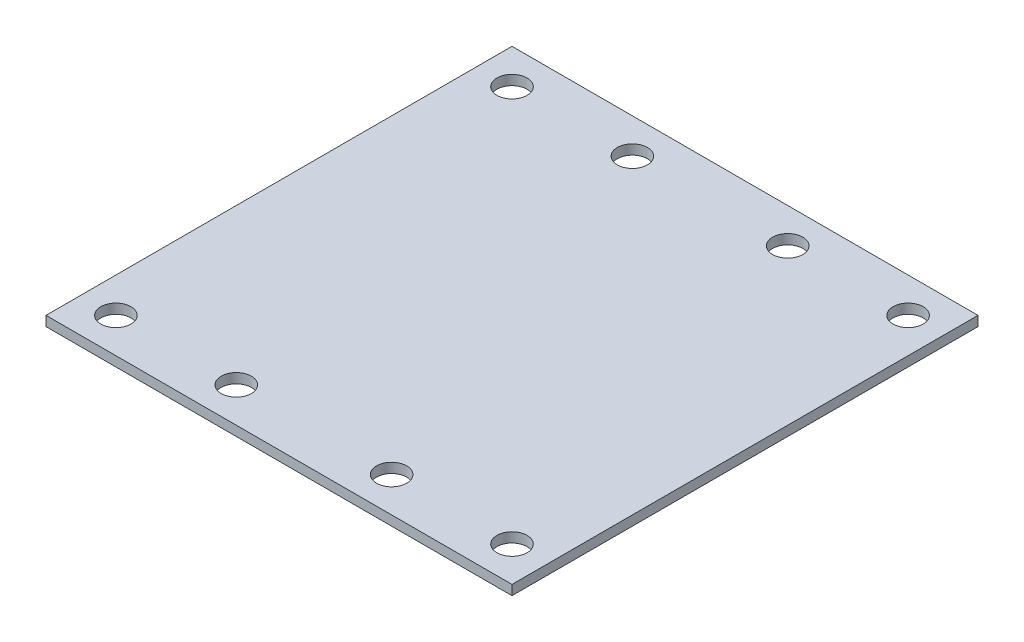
from build123d import *

# Parameters (mm, degrees)
SKETCH1_W           = 76.2
SKETCH1_H           = 76.2
SKETCH1_R           = 2.4638
BOSS_EXTRUDE1_DEPTH = 1.6002


with BuildPart() as part:
    # Sketch1 → Boss-Extrude1 (new body)
    with BuildSketch(Plane(origin=(0, 0, 0), x_dir=(1, 0, 0), z_dir=(0, 1, 0))):
        Rectangle(SKETCH1_W, SKETCH1_H)
        with Locations(Location((-32.385, 32.385, 0), (0, 0, 270))):
            Circle(SKETCH1_R, mode=Mode.SUBTRACT)
        with Locations(Location((32.385, 32.385, 0), (0, 0, 270))):
            Circle(SKETCH1_R, mode=Mode.SUBTRACT)
        with Locations(Location((32.385, -32.385, 0), (0, 0, 270))):
            Circle(SKETCH1_R, mode=Mode.SUBTRACT)
        with Locations(Location((-32.385, -32.385, 0), (0, 0, 270))):
            Circle(SKETCH1_R, mode=Mode.SUBTRACT)
        with Locations(Location((-12.7, 32.385, 0), (0, 0, 270))):
            Circle(SKETCH1_R, mode=Mode.SUBTRACT)
        with Locations(Location((12.7, 32.385, 0), (0, 0, 270))):
            Circle(SKETCH1_R, mode=Mode.SUBTRACT)
        with Locations(Location((12.7, -32.385, 0), (0, 0, 90))):
            Circle(SKETCH1_R, mode=Mode.SUBTRACT)
        with Locations(Location((-12.7, -32.385, 0), (0, 0, 90))):
            Circle(SKETCH1_R, mode=Mode.SUBTRACT)
    extrude(amount=BOSS_EXTRUDE1_DEPTH)


solid = part.part
